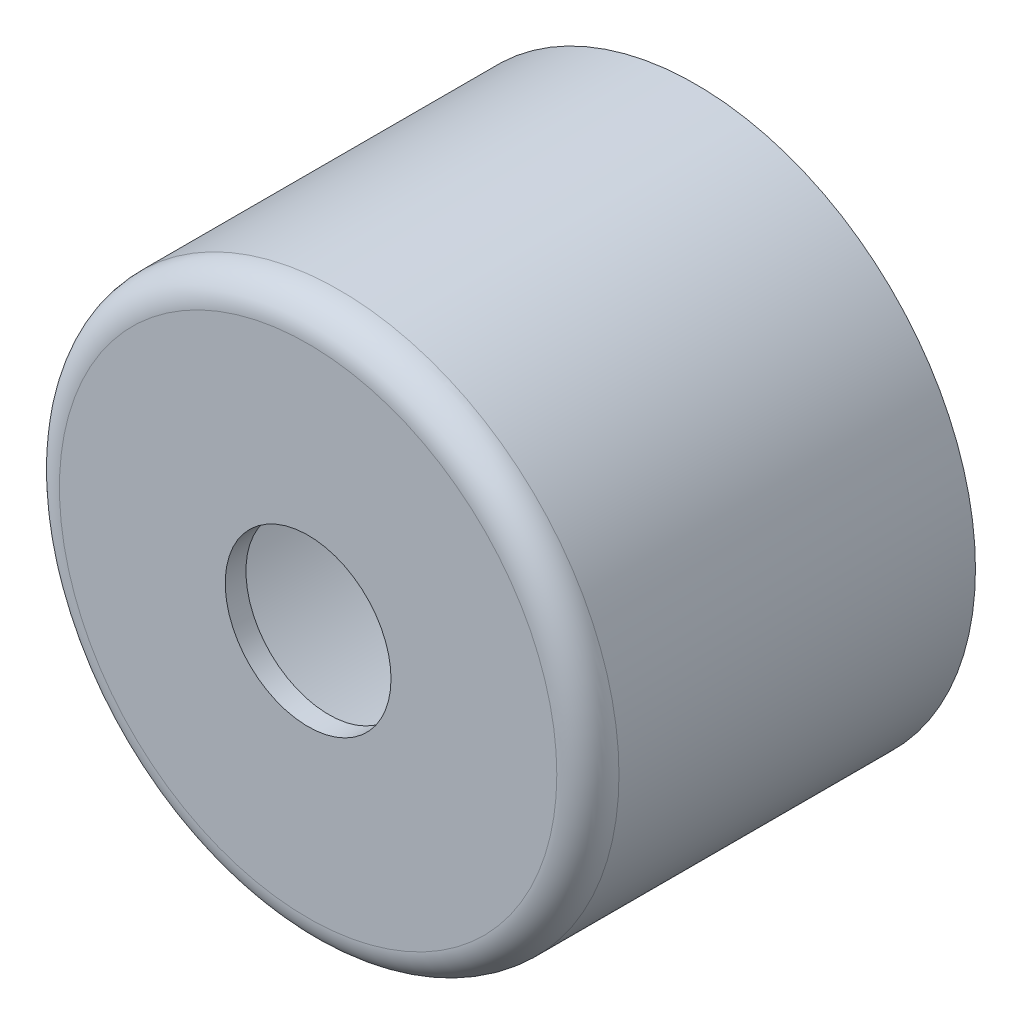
from build123d import *

# Parameters (mm, degrees)
ESQUISSE1_R             = 13.5
EXTRUSION1_DEPTH        = 18.7
CONG_1_R                = 1.5
COQUE1_T                = -1
ESQUISSE2_R             = 4
ENL_V_MAT_EXTRU_1_DEPTH = 27.724333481


with BuildPart() as part:
    # Esquisse1 → Extrusion1 (new body)
    with BuildSketch(Plane.XY):
        Circle(ESQUISSE1_R)
    extrude(amount=EXTRUSION1_DEPTH)

    # Cong_1
    cong_1_edges = [part.edges().sort_by_distance(p)[0] for p in [
        (-13.5, 0, 18.7),
    ]]
    fillet(cong_1_edges, radius=CONG_1_R)

    # Coque1
    coque1_openings = [part.faces().sort_by_distance(p)[0] for p in [
        (0, 0, 0),
    ]]
    offset(amount=COQUE1_T, openings=coque1_openings, kind=Kind.INTERSECTION)

    # Esquisse2 → Enl_v. mat.-Extru.1 (cut, through all)
    with BuildSketch(Plane.XY.offset(18.7)):
        Circle(ESQUISSE2_R)
    extrude(amount=-ENL_V_MAT_EXTRU_1_DEPTH, mode=Mode.SUBTRACT)


solid = part.part
